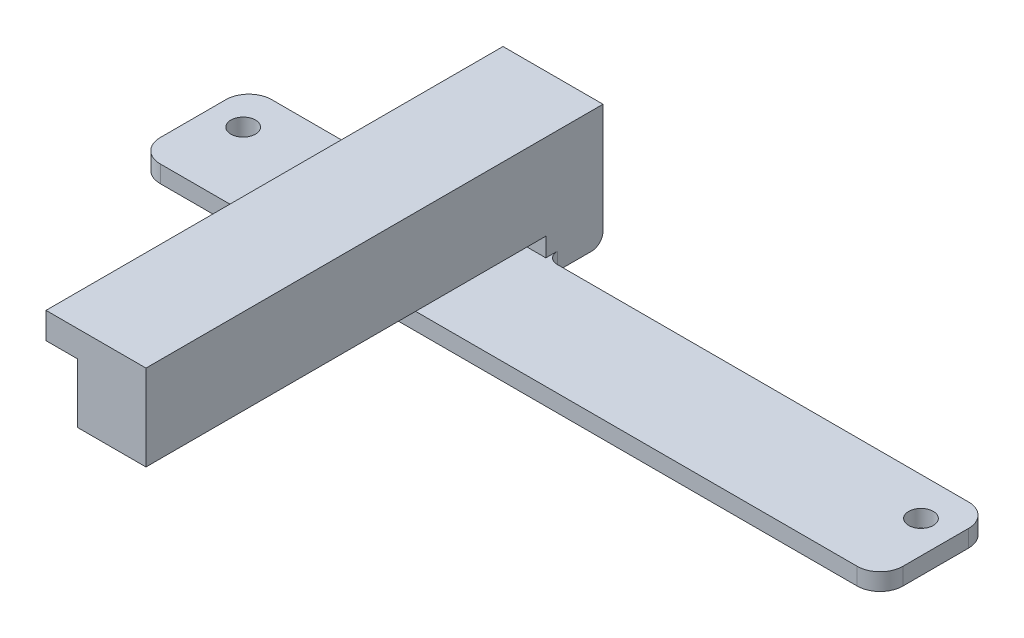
from build123d import *

# Parameters (mm, degrees)
SKETCH1_W                       = 130
SKETCH1_H                       = 19.5
BOSS_EXTRUDE1_DEPTH             = 3
FILLET1_R                       = 4
SKETCH2_W                       = 17.5
SKETCH2_H                       = 10
BOSS_EXTRUDE2_DEPTH             = 18.3
BOSS_EXTRUDE2_DIRECTION_2_REACH = 67.796
FILLET2_R                       = 2
SKETCH4_R                       = 2.15
CUT_EXTRUDE2_DEPTH              = 3
SKETCH3_W                       = 5.5
SKETCH3_H                       = 10.4
CUT_EXTRUDE3_DEPTH              = 10
BOSS_EXTRUDE4_DEPTH             = 70


with BuildPart() as part:
    # Sketch1 → Boss-Extrude1 (new body)
    with BuildSketch(Plane(origin=(0, 0, 0), x_dir=(1, 0, 0), z_dir=(0, 1, 0))):
        Rectangle(SKETCH1_W, SKETCH1_H)
    extrude(amount=BOSS_EXTRUDE1_DEPTH)

    # Fillet1
    fillet1_edges = [part.edges().sort_by_distance(p)[0] for p in [
        (65, 1.5, 9.75),
        (-65, 1.5, 9.75),
        (-65, 1.5, -9.75),
        (65, 1.5, -9.75),
    ]]
    fillet(fillet1_edges, radius=FILLET1_R)

    # Sketch2 → Boss-Extrude2 (add)
    with BuildSketch(Plane(origin=(0, 3, 0), x_dir=(1, 0, 0), z_dir=(0, 1, 0))):
        with Locations((-21.75, 14.75)):
            Rectangle(SKETCH2_W, SKETCH2_H)
    extrude(amount=BOSS_EXTRUDE2_DEPTH)

    # Boss-Extrude2 direction 2: up to this face of the body (flat: up to its plane)
    boss_extrude2_direction_2_end = Plane(part.part.faces().sort_by_distance((0, 0, 0))[0])
    # Sketch2 → Boss-Extrude2 direction 2 (add, up to the picked face)
    with BuildSketch(Plane(origin=(0, 3, 0), x_dir=(1, 0, 0), z_dir=(0, 1, 0)), mode=Mode.PRIVATE) as boss_extrude2_direction_2_sk1:
        with Locations((-21.75, 14.75)):
            Rectangle(SKETCH2_W, SKETCH2_H)
    boss_extrude2_direction_2_tool1 = split(extrude(boss_extrude2_direction_2_sk1.sketch, amount=-BOSS_EXTRUDE2_DIRECTION_2_REACH, mode=Mode.PRIVATE), bisect_by=boss_extrude2_direction_2_end, keep=Keep.BOTH, mode=Mode.PRIVATE)
    add(boss_extrude2_direction_2_tool1.solids().sort_by(Axis((-21.75, 3, -14.75), (0, -1, 0)))[0])

    # Fillet2
    fillet2_edges = [part.edges().sort_by_distance(p)[0] for p in [
        (-13, 1.5, -9.75),
        (-21.75, 0, -19.75),
    ]]
    fillet(fillet2_edges, radius=FILLET2_R)

    # Sketch4 → Cut-Extrude2 (cut)
    with BuildSketch(Plane.XZ):
        with Locations(Location((-59.325, -3.09, 0), (0, 0, 270))):
            Circle(SKETCH4_R)
        with Locations(Location((59.325, -3.09, 0), (0, 0, 270))):
            Circle(SKETCH4_R)
    extrude(amount=-CUT_EXTRUDE2_DEPTH, mode=Mode.SUBTRACT)

    # Sketch3 → Cut-Extrude3 (cut)
    with BuildSketch(Plane.XY.offset(-9.75)):
        with Locations((-27.75, 11.5)):
            Rectangle(SKETCH3_W, SKETCH3_H)
    extrude(amount=-CUT_EXTRUDE3_DEPTH, mode=Mode.SUBTRACT)

    # Sketch6 → Boss-Extrude4 (add)
    with BuildSketch(Plane.XY.offset(-9.75)):
        Polygon((-30.5, 21.3), (-13, 21.3), (-13, 6.3), (-25, 6.3), (-25, 16.7), (-30.5, 16.7), align=None)
    extrude(amount=BOSS_EXTRUDE4_DEPTH)


solid = part.part
